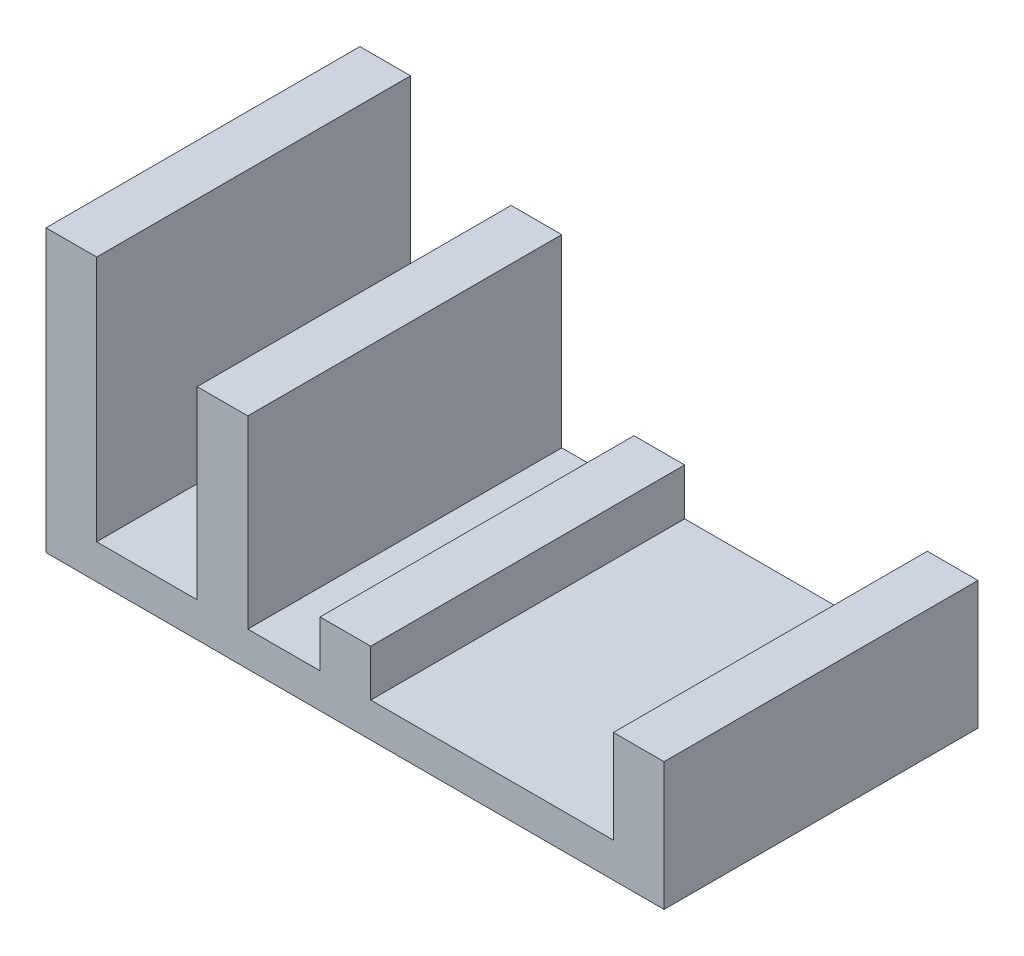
from build123d import *

# Parameters (mm, degrees)
EXTRUDE1_DEPTH = 37.659494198


with BuildPart() as part:
    # Sketch1 → Extrude1 (new, symmetric)
    with BuildSketch(Plane.XY):
        Polygon((0, 67.484549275), (0, 0), (148.290313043, 0), (148.290313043, 30.701558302), (136.137612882, 30.701558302), (136.137612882, 8.315005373), (77.910435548, 8.315005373), (77.910435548, 19.508281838), (65.757735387, 19.508281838), (65.757735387, 8.315005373), (48.421660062, 8.315005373), (48.421660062, 52.61436361), (36.2689599, 52.61436361), (36.2689599, 8.315005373), (12.152700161, 8.315005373), (12.152700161, 67.484549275), align=None)
    extrude(amount=EXTRUDE1_DEPTH, both=True)


solid = part.part
